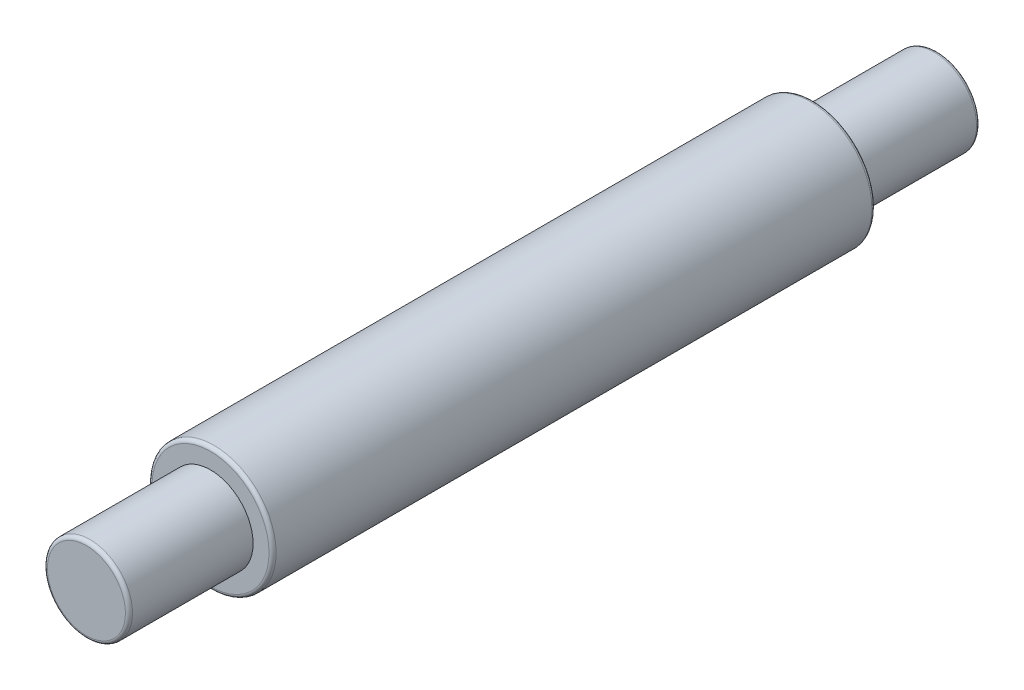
from build123d import *

# Parameters (mm, degrees)
SCHIZZO1_R                   = 12
ESTRUSIONE_ESTRUSIONE1_DEPTH = 120
RACCORDO1_R                  = 1
SCHIZZO2_R                   = 17.5
SCHIZZO2_R_2                 = 12
ESTRUSIONE_ESTRUSIONE2_DEPTH = 85
RACCORDO2_R                  = 1


with BuildPart() as part:
    # Schizzo1 → Estrusione-Estrusione1 (new, symmetric)
    with BuildSketch(Plane.XY):
        Circle(SCHIZZO1_R)
    extrude(amount=ESTRUSIONE_ESTRUSIONE1_DEPTH, both=True)

    # Raccordo1
    raccordo1_edges = [part.edges().sort_by_distance(p)[0] for p in [
        (-12, 0, -120),
        (-12, 0, 120),
    ]]
    fillet(raccordo1_edges, radius=RACCORDO1_R)

    # Schizzo2 → Estrusione-Estrusione2 (add, symmetric)
    with BuildSketch(Plane.XY):
        Circle(SCHIZZO2_R)
        Circle(SCHIZZO2_R_2, mode=Mode.SUBTRACT)
    extrude(amount=ESTRUSIONE_ESTRUSIONE2_DEPTH, both=True)

    # Raccordo2
    raccordo2_edges = [part.edges().sort_by_distance(p)[0] for p in [
        (-17.5, 0, 85),
        (-17.5, 0, -85),
    ]]
    fillet(raccordo2_edges, radius=RACCORDO2_R)


solid = part.part
